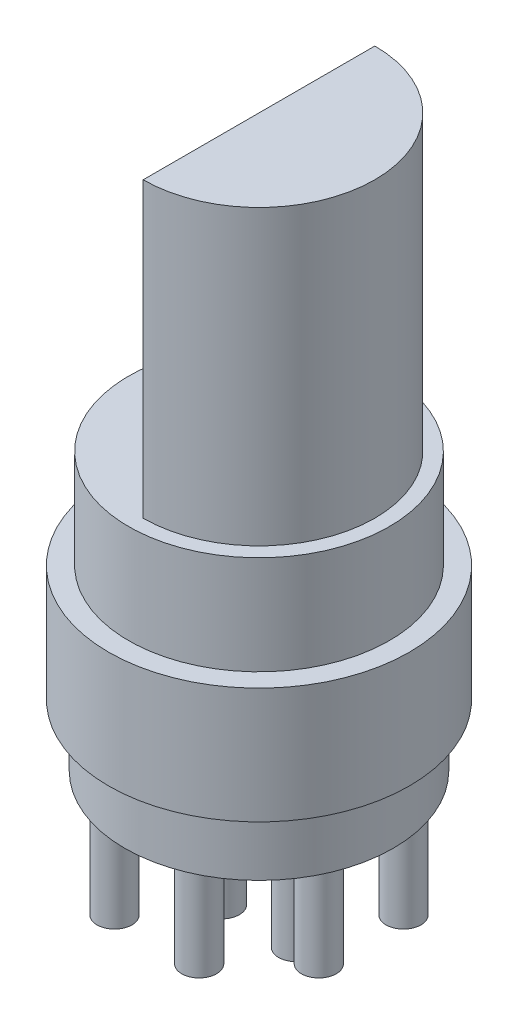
from build123d import *

# Parameters (mm, degrees)
CUT_EXTRUDE1_DEPTH      = 20.248759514
CUT_EXTRUDE1_DEPTH_BACK = 20.248759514
SKETCH2_W               = 4.0513
SKETCH2_H               = 10.2489
SKETCH3_R               = 0.6096
BOSS_EXTRUDE1_DEPTH     = 4.699
SKETCH4_R               = 0.6096
BOSS_EXTRUDE2_DEPTH     = 3.3147
CIRPATTERN1_COUNT       = 8


with BuildPart() as part:
    # Sketch1 → Revolve1 (revolve)
    with BuildSketch(Plane.XY, mode=Mode.PRIVATE) as revolve1_sk:
        Polygon((0, -2.1717), (-4.69265, -2.1717), (-4.69265, 0), (-5.2578, 0), (-5.2578, 4.0513), (-4.5593, 4.0513), (-4.5593, 7.5057), (-4.0513, 7.5057), (-4.0513, 17.7546), (0, 17.7546), align=None)
    revolve(revolve1_sk.sketch.rotate(Axis((0, 0, 0), (0, 1, 0)), 270), axis=Axis((0, 0, 0), (0, 1, 0)))

    # Sketch2 → Cut-Extrude1 (cut, two sides: drawn at the far end of the back side and taken through both)
    with BuildSketch(Plane.XY.offset(-CUT_EXTRUDE1_DEPTH_BACK)):
        with Locations((-2.02565, 12.63015)):
            Rectangle(SKETCH2_W, SKETCH2_H)
    extrude(amount=CUT_EXTRUDE1_DEPTH + CUT_EXTRUDE1_DEPTH_BACK, mode=Mode.SUBTRACT)

    # Sketch3 → Boss-Extrude1 (add)
    with BuildSketch(Plane.XZ.offset(2.1717)):
        with Locations(Location((-1.2954, 0, 0), (0, 0, 90))):
            Circle(SKETCH3_R)
        with Locations(Location((1.2954, 0, 0), (0, 0, 90))):
            Circle(SKETCH3_R)
    extrude(amount=BOSS_EXTRUDE1_DEPTH)

    # Sketch4 → Boss-Extrude2 (add)
    with BuildSketch(Plane.XZ.offset(2.1717)):
        with Locations(Location((-3.572780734, 1.479894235, 0), (0, 0, 90))):
            Circle(SKETCH4_R)
    boss_extrude2 = extrude(amount=BOSS_EXTRUDE2_DEPTH)

    # CirPattern1: Boss-Extrude2 ×8 about axis
    cirpattern1_axis = Axis((0, 0, 0), (0, 1, 0))
    for i in range(1, CIRPATTERN1_COUNT):
        add(boss_extrude2.rotate(cirpattern1_axis, i * 360 / CIRPATTERN1_COUNT))


solid = part.part
